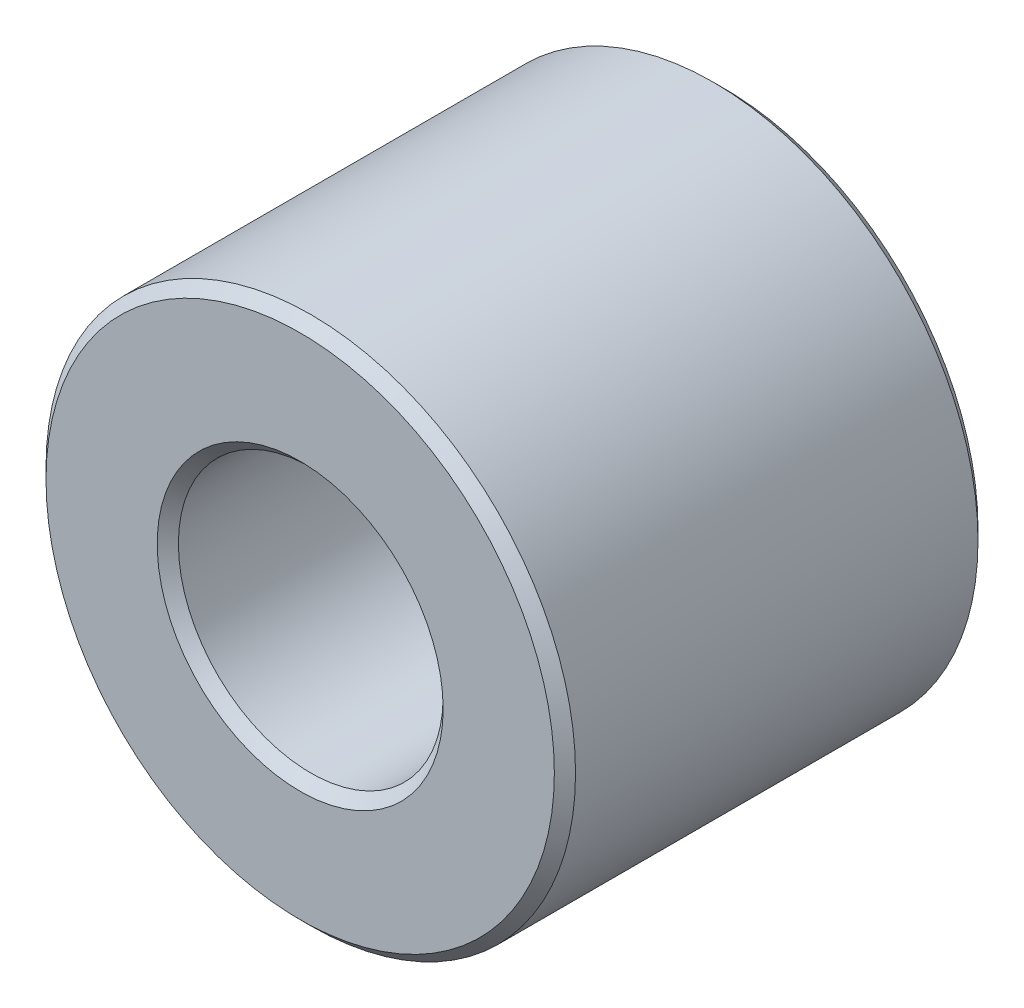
from build123d import *

# Parameters (mm, degrees)
SKETCH1_R           = 2.5
SKETCH1_R_2         = 1.25
BOSS_EXTRUDE2_DEPTH = 2
CHAMFER3_SIZE       = 0.1


with BuildPart() as part:
    # Sketch1 → Boss-Extrude2 (new, symmetric)
    with BuildSketch(Plane.XY):
        Circle(SKETCH1_R)
        Circle(SKETCH1_R_2, mode=Mode.SUBTRACT)
    extrude(amount=BOSS_EXTRUDE2_DEPTH, both=True)

    # Chamfer3
    chamfer3_edges = [part.edges().sort_by_distance(p)[0] for p in [
        (-2.5, 0, -2),
        (-2.5, 0, 2),
        (-1.25, 0, -2),
        (-1.25, 0, 2),
    ]]
    chamfer(chamfer3_edges, length=CHAMFER3_SIZE)


solid = part.part
